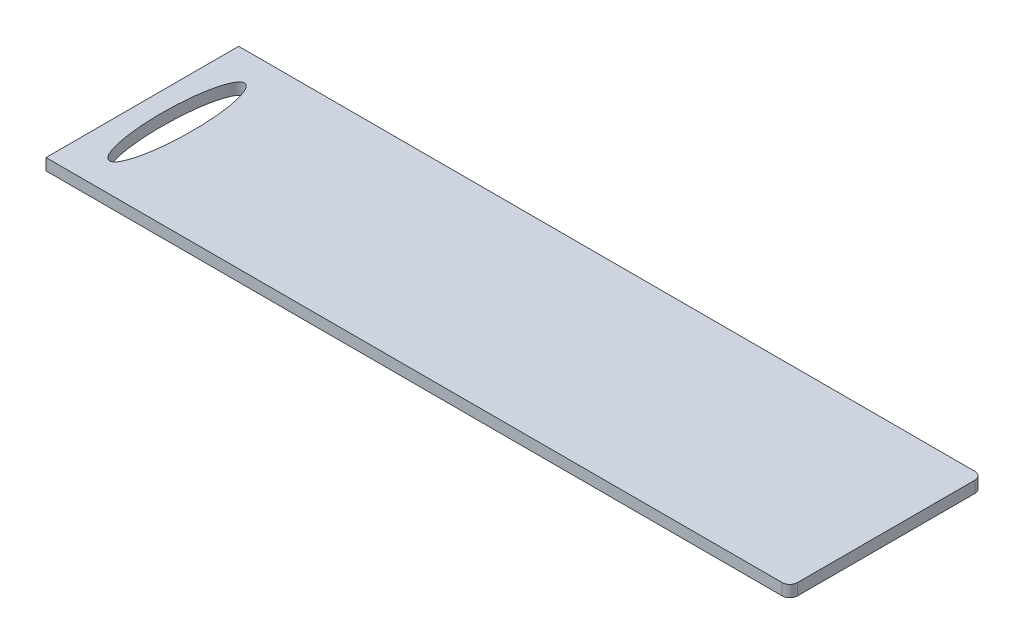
ISO-10303-21;
HEADER;
FILE_DESCRIPTION(('STEP AP214'),'2;1');
FILE_NAME('part.step','',(''),(''),'','','');
FILE_SCHEMA(('AUTOMOTIVE_DESIGN { 1 0 10303 214 1 1 1 1 }'));
ENDSEC;
DATA;
#1=APPLICATION_CONTEXT('core data for automotive mechanical design processes');
#2=APPLICATION_PROTOCOL_DEFINITION('international standard','automotive_design',2000,#1);
#3=PRODUCT_CONTEXT('',#1,'mechanical');
#4=PRODUCT('Part','Part','',(#3));
#5=PRODUCT_RELATED_PRODUCT_CATEGORY('part','',(#4));
#6=PRODUCT_DEFINITION_FORMATION('','',#4);
#7=PRODUCT_DEFINITION_CONTEXT('part definition',#1,'design');
#8=PRODUCT_DEFINITION('design','',#6,#7);
#9=PRODUCT_DEFINITION_SHAPE('','',#8);
#10=(LENGTH_UNIT() NAMED_UNIT(*) SI_UNIT(.MILLI.,.METRE.));
#11=(NAMED_UNIT(*) PLANE_ANGLE_UNIT() SI_UNIT($,.RADIAN.));
#12=(NAMED_UNIT(*) SI_UNIT($,.STERADIAN.) SOLID_ANGLE_UNIT());
#13=UNCERTAINTY_MEASURE_WITH_UNIT(LENGTH_MEASURE(1.E-05),#10,'distance_accuracy_value','');
#14=(GEOMETRIC_REPRESENTATION_CONTEXT(3) GLOBAL_UNCERTAINTY_ASSIGNED_CONTEXT((#13)) GLOBAL_UNIT_ASSIGNED_CONTEXT((#10,
#11,#12)) REPRESENTATION_CONTEXT('',''));
#15=CARTESIAN_POINT('',(0.,0.,0.));
#16=DIRECTION('',(0.,0.,1.));
#17=DIRECTION('',(1.,0.,0.));
#18=AXIS2_PLACEMENT_3D('',#15,#16,#17);
#19=CARTESIAN_POINT('',(122.529108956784,3.,33.5605752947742));
#20=DIRECTION('',(0.,1.,0.));
#21=DIRECTION('',(0.,0.,1.));
#22=AXIS2_PLACEMENT_3D('',#19,#20,#21);
#23=PLANE('',#22);
#24=DIRECTION('',(0.,0.,1.));
#25=VECTOR('',#24,1.);
#26=CARTESIAN_POINT('',(-68.4708910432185,3.,-14.4394247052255));
#27=LINE('',#26,#25);
#28=CARTESIAN_POINT('',(-68.4708910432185,3.,-14.4394247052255));
#29=VERTEX_POINT('',#28);
#30=CARTESIAN_POINT('',(-68.4708910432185,3.,35.5605752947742));
#31=VERTEX_POINT('',#30);
#32=EDGE_CURVE('E130',#29,#31,#27,.T.);
#33=ORIENTED_EDGE('',*,*,#32,.T.);
#34=DIRECTION('',(1.,0.,0.));
#35=VECTOR('',#34,1.);
#36=CARTESIAN_POINT('',(-68.4708910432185,3.,35.5605752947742));
#37=LINE('',#36,#35);
#38=CARTESIAN_POINT('',(122.529108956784,3.,35.5605752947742));
#39=VERTEX_POINT('',#38);
#40=EDGE_CURVE('E88',#31,#39,#37,.T.);
#41=ORIENTED_EDGE('',*,*,#40,.T.);
#42=CARTESIAN_POINT('',(122.529108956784,3.,33.5605752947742));
#43=DIRECTION('',(0.,1.,0.));
#44=DIRECTION('',(0.,0.,1.));
#45=AXIS2_PLACEMENT_3D('',#42,#43,#44);
#46=CIRCLE('',#45,2.);
#47=CARTESIAN_POINT('',(124.529108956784,3.,33.5605752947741));
#48=VERTEX_POINT('',#47);
#49=EDGE_CURVE('E101',#39,#48,#46,.T.);
#50=ORIENTED_EDGE('',*,*,#49,.T.);
#51=DIRECTION('',(0.,0.,-1.));
#52=VECTOR('',#51,1.);
#53=CARTESIAN_POINT('',(124.529108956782,3.,-12.4394247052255));
#54=LINE('',#53,#52);
#55=CARTESIAN_POINT('',(124.529108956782,3.,-12.4394247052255));
#56=VERTEX_POINT('',#55);
#57=EDGE_CURVE('E95',#48,#56,#54,.T.);
#58=ORIENTED_EDGE('',*,*,#57,.T.);
#59=CARTESIAN_POINT('',(122.529108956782,3.,-12.4394247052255));
#60=DIRECTION('',(0.,1.,0.));
#61=DIRECTION('',(0.,0.,-1.));
#62=AXIS2_PLACEMENT_3D('',#59,#60,#61);
#63=CIRCLE('',#62,2.);
#64=CARTESIAN_POINT('',(122.529108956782,3.,-14.4394247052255));
#65=VERTEX_POINT('',#64);
#66=EDGE_CURVE('E99',#56,#65,#63,.T.);
#67=ORIENTED_EDGE('',*,*,#66,.T.);
#68=DIRECTION('',(-1.,0.,0.));
#69=VECTOR('',#68,1.);
#70=CARTESIAN_POINT('',(-68.4708910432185,3.,-14.4394247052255));
#71=LINE('',#70,#69);
#72=EDGE_CURVE('E51',#65,#29,#71,.T.);
#73=ORIENTED_EDGE('',*,*,#72,.T.);
#74=EDGE_LOOP('',(#33,#41,#50,#58,#67,#73));
#75=FACE_BOUND('',#74,.T.);
#76=CARTESIAN_POINT('',(-59.4708910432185,3.,10.5605752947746));
#77=DIRECTION('',(0.,1.,0.));
#78=DIRECTION('',(0.,0.,1.));
#79=AXIS2_PLACEMENT_3D('',#76,#77,#78);
#80=ELLIPSE('',#79,17.4999999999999,4.);
#81=CARTESIAN_POINT('',(-59.4708910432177,3.,28.0605752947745));
#82=VERTEX_POINT('',#81);
#83=EDGE_CURVE('E123',#82,#82,#80,.T.);
#84=ORIENTED_EDGE('',*,*,#83,.F.);
#85=EDGE_LOOP('',(#84));
#86=FACE_BOUND('',#85,.T.);
#87=ADVANCED_FACE('F34',(#75,#86),#23,.T.);
#88=CARTESIAN_POINT('',(122.529108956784,0.,33.5605752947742));
#89=DIRECTION('',(0.,1.,0.));
#90=DIRECTION('',(0.,0.,1.));
#91=AXIS2_PLACEMENT_3D('',#88,#89,#90);
#92=PLANE('',#91);
#93=DIRECTION('',(0.,0.,1.));
#94=VECTOR('',#93,1.);
#95=CARTESIAN_POINT('',(-68.4708910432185,0.,-14.4394247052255));
#96=LINE('',#95,#94);
#97=CARTESIAN_POINT('',(-68.4708910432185,0.,-14.4394247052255));
#98=VERTEX_POINT('',#97);
#99=CARTESIAN_POINT('',(-68.4708910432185,0.,35.5605752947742));
#100=VERTEX_POINT('',#99);
#101=EDGE_CURVE('E119',#98,#100,#96,.T.);
#102=ORIENTED_EDGE('',*,*,#101,.F.);
#103=DIRECTION('',(-1.,0.,0.));
#104=VECTOR('',#103,1.);
#105=CARTESIAN_POINT('',(-68.4708910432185,0.,-14.4394247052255));
#106=LINE('',#105,#104);
#107=CARTESIAN_POINT('',(122.529108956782,0.,-14.4394247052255));
#108=VERTEX_POINT('',#107);
#109=EDGE_CURVE('E80',#108,#98,#106,.T.);
#110=ORIENTED_EDGE('',*,*,#109,.F.);
#111=CARTESIAN_POINT('',(122.529108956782,0.,-12.4394247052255));
#112=DIRECTION('',(0.,1.,0.));
#113=DIRECTION('',(0.,0.,-1.));
#114=AXIS2_PLACEMENT_3D('',#111,#112,#113);
#115=CIRCLE('',#114,2.);
#116=CARTESIAN_POINT('',(124.529108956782,0.,-12.4394247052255));
#117=VERTEX_POINT('',#116);
#118=EDGE_CURVE('E74',#117,#108,#115,.T.);
#119=ORIENTED_EDGE('',*,*,#118,.F.);
#120=DIRECTION('',(0.,0.,-1.));
#121=VECTOR('',#120,1.);
#122=CARTESIAN_POINT('',(124.529108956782,0.,-12.4394247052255));
#123=LINE('',#122,#121);
#124=CARTESIAN_POINT('',(124.529108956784,0.,33.5605752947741));
#125=VERTEX_POINT('',#124);
#126=EDGE_CURVE('E109',#125,#117,#123,.T.);
#127=ORIENTED_EDGE('',*,*,#126,.F.);
#128=CARTESIAN_POINT('',(122.529108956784,0.,33.5605752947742));
#129=DIRECTION('',(0.,1.,0.));
#130=DIRECTION('',(0.,0.,1.));
#131=AXIS2_PLACEMENT_3D('',#128,#129,#130);
#132=CIRCLE('',#131,2.);
#133=CARTESIAN_POINT('',(122.529108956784,0.,35.5605752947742));
#134=VERTEX_POINT('',#133);
#135=EDGE_CURVE('E125',#134,#125,#132,.T.);
#136=ORIENTED_EDGE('',*,*,#135,.F.);
#137=DIRECTION('',(1.,0.,0.));
#138=VECTOR('',#137,1.);
#139=CARTESIAN_POINT('',(-68.4708910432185,0.,35.5605752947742));
#140=LINE('',#139,#138);
#141=EDGE_CURVE('E122',#100,#134,#140,.T.);
#142=ORIENTED_EDGE('',*,*,#141,.F.);
#143=EDGE_LOOP('',(#102,#110,#119,#127,#136,#142));
#144=FACE_BOUND('',#143,.T.);
#145=CARTESIAN_POINT('',(-59.4708910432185,0.,10.5605752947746));
#146=DIRECTION('',(0.,1.,0.));
#147=DIRECTION('',(0.,0.,1.));
#148=AXIS2_PLACEMENT_3D('',#145,#146,#147);
#149=ELLIPSE('',#148,17.4999999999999,4.);
#150=CARTESIAN_POINT('',(-59.4708910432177,0.,28.0605752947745));
#151=VERTEX_POINT('',#150);
#152=EDGE_CURVE('E165',#151,#151,#149,.T.);
#153=ORIENTED_EDGE('',*,*,#152,.T.);
#154=EDGE_LOOP('',(#153));
#155=FACE_BOUND('',#154,.T.);
#156=ADVANCED_FACE('F139',(#144,#155),#92,.F.);
#157=CARTESIAN_POINT('',(-68.4708910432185,3.,-14.4394247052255));
#158=DIRECTION('',(1.,0.,0.));
#159=DIRECTION('',(0.,0.,-1.));
#160=AXIS2_PLACEMENT_3D('',#157,#158,#159);
#161=PLANE('',#160);
#162=ORIENTED_EDGE('',*,*,#101,.T.);
#163=DIRECTION('',(0.,-1.,0.));
#164=VECTOR('',#163,1.);
#165=CARTESIAN_POINT('',(-68.4708910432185,3.,35.5605752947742));
#166=LINE('',#165,#164);
#167=EDGE_CURVE('E11',#31,#100,#166,.T.);
#168=ORIENTED_EDGE('',*,*,#167,.F.);
#169=ORIENTED_EDGE('',*,*,#32,.F.);
#170=DIRECTION('',(0.,-1.,0.));
#171=VECTOR('',#170,1.);
#172=CARTESIAN_POINT('',(-68.4708910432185,3.,-14.4394247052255));
#173=LINE('',#172,#171);
#174=EDGE_CURVE('E115',#29,#98,#173,.T.);
#175=ORIENTED_EDGE('',*,*,#174,.T.);
#176=EDGE_LOOP('',(#162,#168,#169,#175));
#177=FACE_BOUND('',#176,.T.);
#178=ADVANCED_FACE('F36',(#177),#161,.F.);
#179=CARTESIAN_POINT('',(-68.4708910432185,3.,35.5605752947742));
#180=DIRECTION('',(0.,0.,-1.));
#181=DIRECTION('',(-1.,0.,0.));
#182=AXIS2_PLACEMENT_3D('',#179,#180,#181);
#183=PLANE('',#182);
#184=ORIENTED_EDGE('',*,*,#141,.T.);
#185=DIRECTION('',(0.,-1.,0.));
#186=VECTOR('',#185,1.);
#187=CARTESIAN_POINT('',(122.529108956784,3.,35.5605752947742));
#188=LINE('',#187,#186);
#189=EDGE_CURVE('E43',#39,#134,#188,.T.);
#190=ORIENTED_EDGE('',*,*,#189,.F.);
#191=ORIENTED_EDGE('',*,*,#40,.F.);
#192=ORIENTED_EDGE('',*,*,#167,.T.);
#193=EDGE_LOOP('',(#184,#190,#191,#192));
#194=FACE_BOUND('',#193,.T.);
#195=ADVANCED_FACE('F175',(#194),#183,.F.);
#196=CARTESIAN_POINT('',(122.529108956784,3.,33.5605752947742));
#197=DIRECTION('',(0.,-1.,0.));
#198=DIRECTION('',(0.,0.,-1.));
#199=AXIS2_PLACEMENT_3D('',#196,#197,#198);
#200=CYLINDRICAL_SURFACE('',#199,2.);
#201=ORIENTED_EDGE('',*,*,#135,.T.);
#202=DIRECTION('',(0.,-1.,0.));
#203=VECTOR('',#202,1.);
#204=CARTESIAN_POINT('',(124.529108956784,3.,33.5605752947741));
#205=LINE('',#204,#203);
#206=EDGE_CURVE('E110',#48,#125,#205,.T.);
#207=ORIENTED_EDGE('',*,*,#206,.F.);
#208=ORIENTED_EDGE('',*,*,#49,.F.);
#209=ORIENTED_EDGE('',*,*,#189,.T.);
#210=EDGE_LOOP('',(#201,#207,#208,#209));
#211=FACE_BOUND('',#210,.T.);
#212=ADVANCED_FACE('F136',(#211),#200,.T.);
#213=CARTESIAN_POINT('',(124.529108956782,3.,-12.4394247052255));
#214=DIRECTION('',(-1.,0.,0.));
#215=DIRECTION('',(0.,0.,1.));
#216=AXIS2_PLACEMENT_3D('',#213,#214,#215);
#217=PLANE('',#216);
#218=ORIENTED_EDGE('',*,*,#126,.T.);
#219=DIRECTION('',(0.,-1.,0.));
#220=VECTOR('',#219,1.);
#221=CARTESIAN_POINT('',(124.529108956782,3.,-12.4394247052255));
#222=LINE('',#221,#220);
#223=EDGE_CURVE('E106',#56,#117,#222,.T.);
#224=ORIENTED_EDGE('',*,*,#223,.F.);
#225=ORIENTED_EDGE('',*,*,#57,.F.);
#226=ORIENTED_EDGE('',*,*,#206,.T.);
#227=EDGE_LOOP('',(#218,#224,#225,#226));
#228=FACE_BOUND('',#227,.T.);
#229=ADVANCED_FACE('F107',(#228),#217,.F.);
#230=CARTESIAN_POINT('',(122.529108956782,3.,-12.4394247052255));
#231=DIRECTION('',(0.,-1.,0.));
#232=DIRECTION('',(0.,0.,-1.));
#233=AXIS2_PLACEMENT_3D('',#230,#231,#232);
#234=CYLINDRICAL_SURFACE('',#233,2.);
#235=ORIENTED_EDGE('',*,*,#118,.T.);
#236=DIRECTION('',(0.,-1.,0.));
#237=VECTOR('',#236,1.);
#238=CARTESIAN_POINT('',(122.529108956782,3.,-14.4394247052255));
#239=LINE('',#238,#237);
#240=EDGE_CURVE('E111',#65,#108,#239,.T.);
#241=ORIENTED_EDGE('',*,*,#240,.F.);
#242=ORIENTED_EDGE('',*,*,#66,.F.);
#243=ORIENTED_EDGE('',*,*,#223,.T.);
#244=EDGE_LOOP('',(#235,#241,#242,#243));
#245=FACE_BOUND('',#244,.T.);
#246=ADVANCED_FACE('F113',(#245),#234,.T.);
#247=CARTESIAN_POINT('',(-68.4708910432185,3.,-14.4394247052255));
#248=DIRECTION('',(0.,0.,1.));
#249=DIRECTION('',(1.,0.,0.));
#250=AXIS2_PLACEMENT_3D('',#247,#248,#249);
#251=PLANE('',#250);
#252=ORIENTED_EDGE('',*,*,#109,.T.);
#253=ORIENTED_EDGE('',*,*,#174,.F.);
#254=ORIENTED_EDGE('',*,*,#72,.F.);
#255=ORIENTED_EDGE('',*,*,#240,.T.);
#256=EDGE_LOOP('',(#252,#253,#254,#255));
#257=FACE_BOUND('',#256,.T.);
#258=ADVANCED_FACE('F144',(#257),#251,.F.);
#259=DIRECTION('',(0.,-1.,0.));
#260=VECTOR('',#259,1.);
#261=SURFACE_OF_LINEAR_EXTRUSION('',#80,#260);
#262=ORIENTED_EDGE('',*,*,#83,.T.);
#263=EDGE_LOOP('',(#262));
#264=FACE_BOUND('',#263,.T.);
#265=ORIENTED_EDGE('',*,*,#152,.F.);
#266=EDGE_LOOP('',(#265));
#267=FACE_BOUND('',#266,.T.);
#268=ADVANCED_FACE('F146',(#264,#267),#261,.T.);
#269=CLOSED_SHELL('',(#87,#156,#178,#195,#212,#229,#246,#258,#268));
#270=MANIFOLD_SOLID_BREP('B2',#269);
#271=ADVANCED_BREP_SHAPE_REPRESENTATION('',(#18,#270),#14);
#272=SHAPE_DEFINITION_REPRESENTATION(#9,#271);
ENDSEC;
END-ISO-10303-21;
